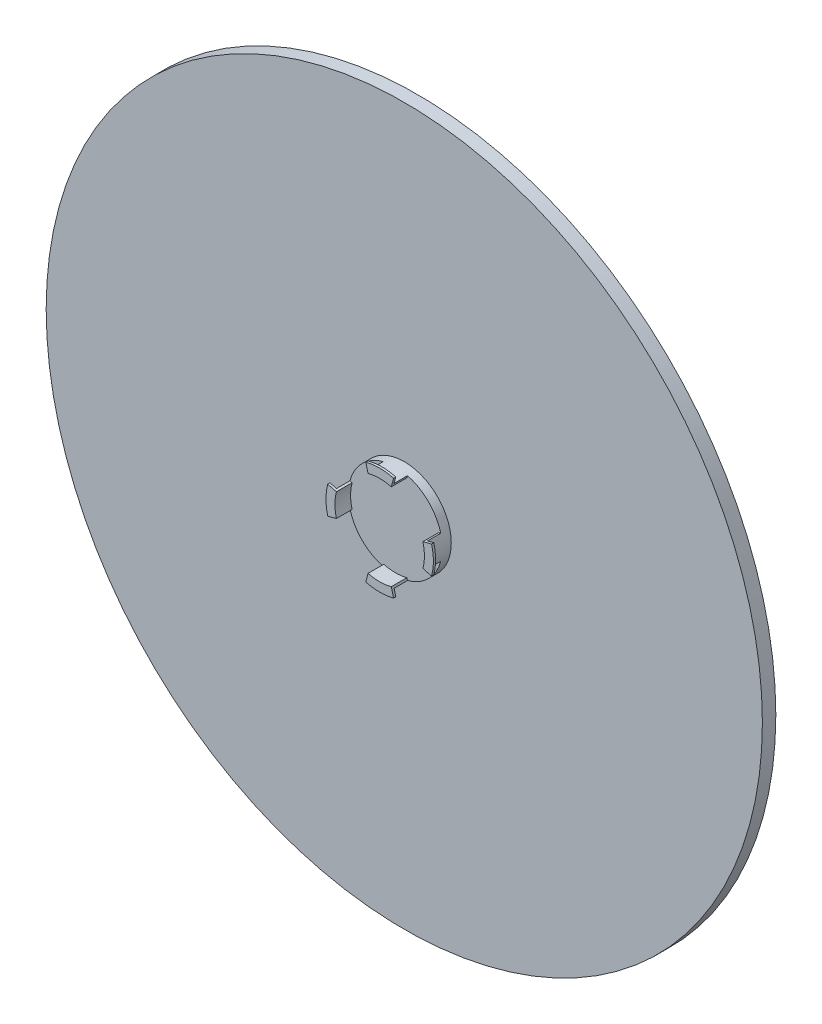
ISO-10303-21;
HEADER;
FILE_DESCRIPTION(('STEP AP214'),'2;1');
FILE_NAME('part.step','',(''),(''),'','','');
FILE_SCHEMA(('AUTOMOTIVE_DESIGN { 1 0 10303 214 1 1 1 1 }'));
ENDSEC;
DATA;
#1=APPLICATION_CONTEXT('core data for automotive mechanical design processes');
#2=APPLICATION_PROTOCOL_DEFINITION('international standard','automotive_design',2000,#1);
#3=PRODUCT_CONTEXT('',#1,'mechanical');
#4=PRODUCT('Part','Part','',(#3));
#5=PRODUCT_RELATED_PRODUCT_CATEGORY('part','',(#4));
#6=PRODUCT_DEFINITION_FORMATION('','',#4);
#7=PRODUCT_DEFINITION_CONTEXT('part definition',#1,'design');
#8=PRODUCT_DEFINITION('design','',#6,#7);
#9=PRODUCT_DEFINITION_SHAPE('','',#8);
#10=(LENGTH_UNIT() NAMED_UNIT(*) SI_UNIT(.MILLI.,.METRE.));
#11=(NAMED_UNIT(*) PLANE_ANGLE_UNIT() SI_UNIT($,.RADIAN.));
#12=(NAMED_UNIT(*) SI_UNIT($,.STERADIAN.) SOLID_ANGLE_UNIT());
#13=UNCERTAINTY_MEASURE_WITH_UNIT(LENGTH_MEASURE(1.E-05),#10,'distance_accuracy_value','');
#14=(GEOMETRIC_REPRESENTATION_CONTEXT(3) GLOBAL_UNCERTAINTY_ASSIGNED_CONTEXT((#13)) GLOBAL_UNIT_ASSIGNED_CONTEXT((#10,
#11,#12)) REPRESENTATION_CONTEXT('',''));
#15=CARTESIAN_POINT('',(0.,0.,0.));
#16=DIRECTION('',(0.,0.,1.));
#17=DIRECTION('',(1.,0.,0.));
#18=AXIS2_PLACEMENT_3D('',#15,#16,#17);
#19=CARTESIAN_POINT('',(-8.88178419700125E-13,8.88178419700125E-13,50.));
#20=DIRECTION('',(0.,0.,1.));
#21=DIRECTION('',(1.,0.,0.));
#22=AXIS2_PLACEMENT_3D('',#19,#20,#21);
#23=PLANE('',#22);
#24=CARTESIAN_POINT('',(-8.88178419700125E-13,8.88178419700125E-13,50.));
#25=DIRECTION('',(0.,0.,-1.));
#26=DIRECTION('',(1.,0.,0.));
#27=AXIS2_PLACEMENT_3D('',#24,#25,#26);
#28=CIRCLE('',#27,100.);
#29=CARTESIAN_POINT('',(25.8819045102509,-96.5925826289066,50.));
#30=VERTEX_POINT('',#29);
#31=CARTESIAN_POINT('',(-25.8819045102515,-96.592582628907,50.));
#32=VERTEX_POINT('',#31);
#33=EDGE_CURVE('E48',#30,#32,#28,.T.);
#34=ORIENTED_EDGE('',*,*,#33,.F.);
#35=DIRECTION('',(-0.258819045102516,0.965925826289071,0.));
#36=VECTOR('',#35,1.);
#37=CARTESIAN_POINT('',(25.8819045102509,-96.5925826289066,50.));
#38=LINE('',#37,#36);
#39=CARTESIAN_POINT('',(27.1759997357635,-101.422211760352,50.));
#40=VERTEX_POINT('',#39);
#41=EDGE_CURVE('E300',#40,#30,#38,.T.);
#42=ORIENTED_EDGE('',*,*,#41,.F.);
#43=CARTESIAN_POINT('',(-8.88178419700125E-13,8.88178419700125E-13,50.));
#44=DIRECTION('',(0.,0.,1.));
#45=DIRECTION('',(1.,0.,0.));
#46=AXIS2_PLACEMENT_3D('',#43,#44,#45);
#47=CIRCLE('',#46,105.);
#48=CARTESIAN_POINT('',(101.422211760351,-27.1759997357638,50.));
#49=VERTEX_POINT('',#48);
#50=EDGE_CURVE('E34',#40,#49,#47,.T.);
#51=ORIENTED_EDGE('',*,*,#50,.T.);
#52=DIRECTION('',(0.965925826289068,-0.258819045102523,0.));
#53=VECTOR('',#52,1.);
#54=CARTESIAN_POINT('',(96.5925826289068,-25.8819045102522,50.));
#55=LINE('',#54,#53);
#56=CARTESIAN_POINT('',(96.5925826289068,-25.8819045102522,50.));
#57=VERTEX_POINT('',#56);
#58=EDGE_CURVE('E318',#57,#49,#55,.T.);
#59=ORIENTED_EDGE('',*,*,#58,.F.);
#60=CARTESIAN_POINT('',(-8.88178419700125E-13,8.88178419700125E-13,50.));
#61=DIRECTION('',(0.,0.,-1.));
#62=DIRECTION('',(1.,0.,0.));
#63=AXIS2_PLACEMENT_3D('',#60,#61,#62);
#64=CIRCLE('',#63,100.);
#65=CARTESIAN_POINT('',(96.5925826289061,25.8819045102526,50.));
#66=VERTEX_POINT('',#65);
#67=EDGE_CURVE('E321',#66,#57,#64,.T.);
#68=ORIENTED_EDGE('',*,*,#67,.F.);
#69=DIRECTION('',(-0.965925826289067,-0.25881904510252,0.));
#70=VECTOR('',#69,1.);
#71=CARTESIAN_POINT('',(96.5925826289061,25.8819045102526,50.));
#72=LINE('',#71,#70);
#73=CARTESIAN_POINT('',(101.422211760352,27.1759997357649,50.));
#74=VERTEX_POINT('',#73);
#75=EDGE_CURVE('E313',#74,#66,#72,.T.);
#76=ORIENTED_EDGE('',*,*,#75,.F.);
#77=CARTESIAN_POINT('',(27.175999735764,101.422211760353,50.));
#78=VERTEX_POINT('',#77);
#79=EDGE_CURVE('E391',#74,#78,#47,.T.);
#80=ORIENTED_EDGE('',*,*,#79,.T.);
#81=DIRECTION('',(0.258819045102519,0.965925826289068,0.));
#82=VECTOR('',#81,1.);
#83=CARTESIAN_POINT('',(25.8819045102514,96.5925826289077,50.));
#84=LINE('',#83,#82);
#85=CARTESIAN_POINT('',(25.8819045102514,96.5925826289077,50.));
#86=VERTEX_POINT('',#85);
#87=EDGE_CURVE('E342',#86,#78,#84,.T.);
#88=ORIENTED_EDGE('',*,*,#87,.F.);
#89=CARTESIAN_POINT('',(-8.88178419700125E-13,8.88178419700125E-13,50.));
#90=DIRECTION('',(0.,0.,-1.));
#91=DIRECTION('',(1.,0.,0.));
#92=AXIS2_PLACEMENT_3D('',#89,#90,#91);
#93=CIRCLE('',#92,100.);
#94=CARTESIAN_POINT('',(-25.8819045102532,96.5925826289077,50.));
#95=VERTEX_POINT('',#94);
#96=EDGE_CURVE('E344',#95,#86,#93,.T.);
#97=ORIENTED_EDGE('',*,*,#96,.F.);
#98=DIRECTION('',(0.258819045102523,-0.965925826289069,0.));
#99=VECTOR('',#98,1.);
#100=CARTESIAN_POINT('',(-25.8819045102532,96.5925826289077,50.));
#101=LINE('',#100,#99);
#102=CARTESIAN_POINT('',(-27.1759997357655,101.422211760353,49.9999999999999));
#103=VERTEX_POINT('',#102);
#104=EDGE_CURVE('E337',#103,#95,#101,.T.);
#105=ORIENTED_EDGE('',*,*,#104,.F.);
#106=CARTESIAN_POINT('',(-101.422211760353,27.175999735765,50.));
#107=VERTEX_POINT('',#106);
#108=EDGE_CURVE('E390',#103,#107,#47,.T.);
#109=ORIENTED_EDGE('',*,*,#108,.T.);
#110=DIRECTION('',(-0.96592582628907,0.258819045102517,0.));
#111=VECTOR('',#110,1.);
#112=CARTESIAN_POINT('',(-96.5925826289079,25.8819045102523,50.));
#113=LINE('',#112,#111);
#114=CARTESIAN_POINT('',(-96.5925826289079,25.8819045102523,50.));
#115=VERTEX_POINT('',#114);
#116=EDGE_CURVE('E366',#115,#107,#113,.T.);
#117=ORIENTED_EDGE('',*,*,#116,.F.);
#118=CARTESIAN_POINT('',(-8.88178419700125E-13,8.88178419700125E-13,50.));
#119=DIRECTION('',(0.,0.,-1.));
#120=DIRECTION('',(1.,0.,0.));
#121=AXIS2_PLACEMENT_3D('',#118,#119,#120);
#122=CIRCLE('',#121,100.);
#123=CARTESIAN_POINT('',(-96.5925826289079,-25.8819045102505,50.));
#124=VERTEX_POINT('',#123);
#125=EDGE_CURVE('E358',#124,#115,#122,.T.);
#126=ORIENTED_EDGE('',*,*,#125,.F.);
#127=DIRECTION('',(0.96592582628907,0.258819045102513,0.));
#128=VECTOR('',#127,1.);
#129=CARTESIAN_POINT('',(-96.5925826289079,-25.8819045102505,50.));
#130=LINE('',#129,#128);
#131=CARTESIAN_POINT('',(-101.422211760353,-27.1759997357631,50.));
#132=VERTEX_POINT('',#131);
#133=EDGE_CURVE('E363',#132,#124,#130,.T.);
#134=ORIENTED_EDGE('',*,*,#133,.F.);
#135=CARTESIAN_POINT('',(-27.1759997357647,-101.422211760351,50.));
#136=VERTEX_POINT('',#135);
#137=EDGE_CURVE('E374',#132,#136,#47,.T.);
#138=ORIENTED_EDGE('',*,*,#137,.T.);
#139=DIRECTION('',(-0.258819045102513,-0.96592582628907,0.));
#140=VECTOR('',#139,1.);
#141=CARTESIAN_POINT('',(-25.8819045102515,-96.592582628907,50.));
#142=LINE('',#141,#140);
#143=EDGE_CURVE('E53',#32,#136,#142,.T.);
#144=ORIENTED_EDGE('',*,*,#143,.F.);
#145=EDGE_LOOP('',(#34,#42,#51,#59,#68,#76,#80,#88,#97,#105,#109,#117,#126,#134,#138,#144));
#146=FACE_BOUND('',#145,.T.);
#147=ADVANCED_FACE('F30',(#146),#23,.T.);
#148=CARTESIAN_POINT('',(0.,0.,30.));
#149=DIRECTION('',(0.,0.,1.));
#150=DIRECTION('',(1.,0.,0.));
#151=AXIS2_PLACEMENT_3D('',#148,#149,#150);
#152=PLANE('',#151);
#153=CARTESIAN_POINT('',(0.,0.,30.));
#154=DIRECTION('',(0.,0.,1.));
#155=DIRECTION('',(1.,0.,0.));
#156=AXIS2_PLACEMENT_3D('',#153,#154,#155);
#157=CIRCLE('',#156,800.);
#158=CARTESIAN_POINT('',(800.,-1.19904086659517E-12,30.));
#159=VERTEX_POINT('',#158);
#160=EDGE_CURVE('E11',#159,#159,#157,.T.);
#161=ORIENTED_EDGE('',*,*,#160,.T.);
#162=EDGE_LOOP('',(#161));
#163=FACE_BOUND('',#162,.T.);
#164=CARTESIAN_POINT('',(0.,0.,30.));
#165=DIRECTION('',(0.,0.,1.));
#166=DIRECTION('',(1.,0.,0.));
#167=AXIS2_PLACEMENT_3D('',#164,#165,#166);
#168=CIRCLE('',#167,105.);
#169=CARTESIAN_POINT('',(105.,-1.57374113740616E-13,30.));
#170=VERTEX_POINT('',#169);
#171=EDGE_CURVE('E392',#170,#170,#168,.T.);
#172=ORIENTED_EDGE('',*,*,#171,.F.);
#173=EDGE_LOOP('',(#172));
#174=FACE_BOUND('',#173,.T.);
#175=ADVANCED_FACE('F443',(#163,#174),#152,.T.);
#176=CARTESIAN_POINT('',(0.,0.,30.));
#177=DIRECTION('',(0.,0.,-1.));
#178=DIRECTION('',(-1.,0.,0.));
#179=AXIS2_PLACEMENT_3D('',#176,#177,#178);
#180=CYLINDRICAL_SURFACE('',#179,800.);
#181=ORIENTED_EDGE('',*,*,#160,.F.);
#182=EDGE_LOOP('',(#181));
#183=FACE_BOUND('',#182,.T.);
#184=CARTESIAN_POINT('',(0.,-1.11022302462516E-13,0.));
#185=DIRECTION('',(0.,0.,1.));
#186=DIRECTION('',(1.,0.,0.));
#187=AXIS2_PLACEMENT_3D('',#184,#185,#186);
#188=CIRCLE('',#187,800.);
#189=CARTESIAN_POINT('',(800.,-1.31006316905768E-12,0.));
#190=VERTEX_POINT('',#189);
#191=EDGE_CURVE('E40',#190,#190,#188,.T.);
#192=ORIENTED_EDGE('',*,*,#191,.T.);
#193=EDGE_LOOP('',(#192));
#194=FACE_BOUND('',#193,.T.);
#195=ADVANCED_FACE('F32',(#183,#194),#180,.T.);
#196=CARTESIAN_POINT('',(0.,-1.11022302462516E-13,0.));
#197=DIRECTION('',(0.,0.,1.));
#198=DIRECTION('',(1.,0.,0.));
#199=AXIS2_PLACEMENT_3D('',#196,#197,#198);
#200=PLANE('',#199);
#201=ORIENTED_EDGE('',*,*,#191,.F.);
#202=EDGE_LOOP('',(#201));
#203=FACE_BOUND('',#202,.T.);
#204=ADVANCED_FACE('F454',(#203),#200,.F.);
#205=CARTESIAN_POINT('',(-8.88178419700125E-13,8.88178419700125E-13,50.));
#206=DIRECTION('',(0.,0.,-1.));
#207=DIRECTION('',(-1.,0.,0.));
#208=AXIS2_PLACEMENT_3D('',#205,#206,#207);
#209=CYLINDRICAL_SURFACE('',#208,105.);
#210=ORIENTED_EDGE('',*,*,#137,.F.);
#211=DIRECTION('',(0.,0.,-1.));
#212=VECTOR('',#211,1.);
#213=CARTESIAN_POINT('',(-101.422211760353,-27.1759997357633,80.));
#214=LINE('',#213,#212);
#215=CARTESIAN_POINT('',(-101.422211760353,-27.1759997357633,80.));
#216=VERTEX_POINT('',#215);
#217=EDGE_CURVE('E379',#216,#132,#214,.T.);
#218=ORIENTED_EDGE('',*,*,#217,.F.);
#219=CARTESIAN_POINT('',(-9.99200722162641E-13,9.99200722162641E-13,80.));
#220=DIRECTION('',(0.,0.,1.));
#221=DIRECTION('',(1.,0.,0.));
#222=AXIS2_PLACEMENT_3D('',#219,#220,#221);
#223=CIRCLE('',#222,105.);
#224=CARTESIAN_POINT('',(-101.422211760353,27.1759997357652,80.));
#225=VERTEX_POINT('',#224);
#226=EDGE_CURVE('E359',#225,#216,#223,.T.);
#227=ORIENTED_EDGE('',*,*,#226,.F.);
#228=DIRECTION('',(0.,0.,-1.));
#229=VECTOR('',#228,1.);
#230=CARTESIAN_POINT('',(-101.422211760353,27.1759997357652,80.));
#231=LINE('',#230,#229);
#232=EDGE_CURVE('E375',#225,#107,#231,.T.);
#233=ORIENTED_EDGE('',*,*,#232,.T.);
#234=ORIENTED_EDGE('',*,*,#108,.F.);
#235=DIRECTION('',(0.,0.,-1.));
#236=VECTOR('',#235,1.);
#237=CARTESIAN_POINT('',(-27.1759997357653,101.422211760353,80.));
#238=LINE('',#237,#236);
#239=CARTESIAN_POINT('',(-27.1759997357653,101.422211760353,80.));
#240=VERTEX_POINT('',#239);
#241=EDGE_CURVE('E356',#240,#103,#238,.T.);
#242=ORIENTED_EDGE('',*,*,#241,.F.);
#243=CARTESIAN_POINT('',(-9.99200722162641E-13,9.99200722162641E-13,80.));
#244=DIRECTION('',(0.,0.,1.));
#245=DIRECTION('',(1.,0.,0.));
#246=AXIS2_PLACEMENT_3D('',#243,#244,#245);
#247=CIRCLE('',#246,105.);
#248=CARTESIAN_POINT('',(27.1759997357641,101.422211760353,80.));
#249=VERTEX_POINT('',#248);
#250=EDGE_CURVE('E338',#249,#240,#247,.T.);
#251=ORIENTED_EDGE('',*,*,#250,.F.);
#252=DIRECTION('',(0.,0.,-1.));
#253=VECTOR('',#252,1.);
#254=CARTESIAN_POINT('',(27.1759997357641,101.422211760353,80.));
#255=LINE('',#254,#253);
#256=EDGE_CURVE('E341',#249,#78,#255,.T.);
#257=ORIENTED_EDGE('',*,*,#256,.T.);
#258=ORIENTED_EDGE('',*,*,#79,.F.);
#259=DIRECTION('',(0.,0.,-1.));
#260=VECTOR('',#259,1.);
#261=CARTESIAN_POINT('',(101.422211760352,27.175999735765,80.));
#262=LINE('',#261,#260);
#263=CARTESIAN_POINT('',(101.422211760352,27.175999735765,80.));
#264=VERTEX_POINT('',#263);
#265=EDGE_CURVE('E334',#264,#74,#262,.T.);
#266=ORIENTED_EDGE('',*,*,#265,.F.);
#267=CARTESIAN_POINT('',(-9.99200722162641E-13,9.99200722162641E-13,80.));
#268=DIRECTION('',(0.,0.,1.));
#269=DIRECTION('',(1.,0.,0.));
#270=AXIS2_PLACEMENT_3D('',#267,#268,#269);
#271=CIRCLE('',#270,105.);
#272=CARTESIAN_POINT('',(101.422211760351,-27.1759997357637,80.));
#273=VERTEX_POINT('',#272);
#274=EDGE_CURVE('E314',#273,#264,#271,.T.);
#275=ORIENTED_EDGE('',*,*,#274,.F.);
#276=DIRECTION('',(0.,0.,-1.));
#277=VECTOR('',#276,1.);
#278=CARTESIAN_POINT('',(101.422211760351,-27.1759997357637,80.));
#279=LINE('',#278,#277);
#280=EDGE_CURVE('E317',#273,#49,#279,.T.);
#281=ORIENTED_EDGE('',*,*,#280,.T.);
#282=ORIENTED_EDGE('',*,*,#50,.F.);
#283=DIRECTION('',(0.,0.,-1.));
#284=VECTOR('',#283,1.);
#285=CARTESIAN_POINT('',(27.1759997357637,-101.422211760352,80.));
#286=LINE('',#285,#284);
#287=CARTESIAN_POINT('',(27.1759997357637,-101.422211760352,80.));
#288=VERTEX_POINT('',#287);
#289=EDGE_CURVE('E310',#288,#40,#286,.T.);
#290=ORIENTED_EDGE('',*,*,#289,.F.);
#291=CARTESIAN_POINT('',(-9.99200722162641E-13,9.99200722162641E-13,80.));
#292=DIRECTION('',(0.,0.,1.));
#293=DIRECTION('',(1.,0.,0.));
#294=AXIS2_PLACEMENT_3D('',#291,#292,#293);
#295=CIRCLE('',#294,105.);
#296=CARTESIAN_POINT('',(-27.1759997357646,-101.422211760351,80.));
#297=VERTEX_POINT('',#296);
#298=EDGE_CURVE('E301',#297,#288,#295,.T.);
#299=ORIENTED_EDGE('',*,*,#298,.F.);
#300=DIRECTION('',(0.,0.,-1.));
#301=VECTOR('',#300,1.);
#302=CARTESIAN_POINT('',(-27.1759997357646,-101.422211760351,80.));
#303=LINE('',#302,#301);
#304=EDGE_CURVE('E201',#297,#136,#303,.T.);
#305=ORIENTED_EDGE('',*,*,#304,.T.);
#306=EDGE_LOOP('',(#210,#218,#227,#233,#234,#242,#251,#257,#258,#266,#275,#281,#282,#290,#299,#305));
#307=FACE_BOUND('',#306,.T.);
#308=ORIENTED_EDGE('',*,*,#171,.T.);
#309=EDGE_LOOP('',(#308));
#310=FACE_BOUND('',#309,.T.);
#311=ADVANCED_FACE('F417',(#307,#310),#209,.T.);
#312=CARTESIAN_POINT('',(-9.99200722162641E-13,9.99200722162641E-13,80.));
#313=DIRECTION('',(0.,0.,-1.));
#314=DIRECTION('',(-1.,0.,0.));
#315=AXIS2_PLACEMENT_3D('',#312,#313,#314);
#316=CYLINDRICAL_SURFACE('',#315,100.);
#317=ORIENTED_EDGE('',*,*,#125,.T.);
#318=DIRECTION('',(0.,0.,-1.));
#319=VECTOR('',#318,1.);
#320=CARTESIAN_POINT('',(-96.5925826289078,25.8819045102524,80.));
#321=LINE('',#320,#319);
#322=CARTESIAN_POINT('',(-96.5925826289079,25.8819045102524,85.));
#323=VERTEX_POINT('',#322);
#324=EDGE_CURVE('E378',#323,#115,#321,.T.);
#325=ORIENTED_EDGE('',*,*,#324,.F.);
#326=CARTESIAN_POINT('',(-8.88178419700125E-13,9.99200722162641E-13,85.));
#327=DIRECTION('',(0.,0.,-1.));
#328=DIRECTION('',(1.,0.,0.));
#329=AXIS2_PLACEMENT_3D('',#326,#327,#328);
#330=CIRCLE('',#329,100.);
#331=CARTESIAN_POINT('',(-96.5925826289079,-25.8819045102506,85.));
#332=VERTEX_POINT('',#331);
#333=EDGE_CURVE('E232',#332,#323,#330,.T.);
#334=ORIENTED_EDGE('',*,*,#333,.F.);
#335=DIRECTION('',(0.,0.,-1.));
#336=VECTOR('',#335,1.);
#337=CARTESIAN_POINT('',(-96.5925826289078,-25.8819045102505,80.));
#338=LINE('',#337,#336);
#339=EDGE_CURVE('E362',#332,#124,#338,.T.);
#340=ORIENTED_EDGE('',*,*,#339,.T.);
#341=EDGE_LOOP('',(#317,#325,#334,#340));
#342=FACE_BOUND('',#341,.T.);
#343=ADVANCED_FACE('F409',(#342),#316,.F.);
#344=CARTESIAN_POINT('',(-96.5925826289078,25.8819045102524,80.));
#345=DIRECTION('',(-0.258819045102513,-0.96592582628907,0.));
#346=DIRECTION('',(0.96592582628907,-0.258819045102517,0.));
#347=AXIS2_PLACEMENT_3D('',#344,#345,#346);
#348=PLANE('',#347);
#349=ORIENTED_EDGE('',*,*,#116,.T.);
#350=ORIENTED_EDGE('',*,*,#232,.F.);
#351=DIRECTION('',(-0.96592582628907,0.258819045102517,0.));
#352=VECTOR('',#351,1.);
#353=CARTESIAN_POINT('',(-96.5925826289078,25.8819045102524,80.));
#354=LINE('',#353,#352);
#355=CARTESIAN_POINT('',(-115.911099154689,31.0582854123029,80.));
#356=VERTEX_POINT('',#355);
#357=EDGE_CURVE('E231',#225,#356,#354,.T.);
#358=ORIENTED_EDGE('',*,*,#357,.T.);
#359=DIRECTION('',(0.,0.,-1.));
#360=VECTOR('',#359,1.);
#361=CARTESIAN_POINT('',(-115.911099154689,31.0582854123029,85.));
#362=LINE('',#361,#360);
#363=CARTESIAN_POINT('',(-115.911099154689,31.0582854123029,85.));
#364=VERTEX_POINT('',#363);
#365=EDGE_CURVE('E251',#364,#356,#362,.T.);
#366=ORIENTED_EDGE('',*,*,#365,.F.);
#367=DIRECTION('',(-0.96592582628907,0.258819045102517,0.));
#368=VECTOR('',#367,1.);
#369=CARTESIAN_POINT('',(-96.5925826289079,25.8819045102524,85.));
#370=LINE('',#369,#368);
#371=EDGE_CURVE('E235',#323,#364,#370,.T.);
#372=ORIENTED_EDGE('',*,*,#371,.F.);
#373=ORIENTED_EDGE('',*,*,#324,.T.);
#374=EDGE_LOOP('',(#349,#350,#358,#366,#372,#373));
#375=FACE_BOUND('',#374,.T.);
#376=ADVANCED_FACE('F404',(#375),#348,.F.);
#377=CARTESIAN_POINT('',(-96.5925826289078,-25.8819045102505,80.));
#378=DIRECTION('',(-0.258819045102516,0.965925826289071,0.));
#379=DIRECTION('',(-0.96592582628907,-0.258819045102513,0.));
#380=AXIS2_PLACEMENT_3D('',#377,#378,#379);
#381=PLANE('',#380);
#382=ORIENTED_EDGE('',*,*,#133,.T.);
#383=ORIENTED_EDGE('',*,*,#339,.F.);
#384=DIRECTION('',(0.96592582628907,0.258819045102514,0.));
#385=VECTOR('',#384,1.);
#386=CARTESIAN_POINT('',(-96.5925826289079,-25.8819045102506,85.));
#387=LINE('',#386,#385);
#388=CARTESIAN_POINT('',(-115.911099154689,-31.0582854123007,85.));
#389=VERTEX_POINT('',#388);
#390=EDGE_CURVE('E240',#389,#332,#387,.T.);
#391=ORIENTED_EDGE('',*,*,#390,.F.);
#392=DIRECTION('',(0.,0.,-1.));
#393=VECTOR('',#392,1.);
#394=CARTESIAN_POINT('',(-115.911099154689,-31.0582854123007,85.));
#395=LINE('',#394,#393);
#396=CARTESIAN_POINT('',(-115.911099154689,-31.0582854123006,80.));
#397=VERTEX_POINT('',#396);
#398=EDGE_CURVE('E243',#389,#397,#395,.T.);
#399=ORIENTED_EDGE('',*,*,#398,.T.);
#400=DIRECTION('',(0.96592582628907,0.258819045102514,0.));
#401=VECTOR('',#400,1.);
#402=CARTESIAN_POINT('',(-96.5925826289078,-25.8819045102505,80.));
#403=LINE('',#402,#401);
#404=EDGE_CURVE('E236',#397,#216,#403,.T.);
#405=ORIENTED_EDGE('',*,*,#404,.T.);
#406=ORIENTED_EDGE('',*,*,#217,.T.);
#407=EDGE_LOOP('',(#382,#383,#391,#399,#405,#406));
#408=FACE_BOUND('',#407,.T.);
#409=ADVANCED_FACE('F412',(#408),#381,.F.);
#410=CARTESIAN_POINT('',(-25.8819045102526,96.5925826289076,80.));
#411=DIRECTION('',(0.965925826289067,0.25881904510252,0.));
#412=DIRECTION('',(-0.258819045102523,0.965925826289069,0.));
#413=AXIS2_PLACEMENT_3D('',#410,#411,#412);
#414=PLANE('',#413);
#415=ORIENTED_EDGE('',*,*,#104,.T.);
#416=DIRECTION('',(0.,0.,-1.));
#417=VECTOR('',#416,1.);
#418=CARTESIAN_POINT('',(-25.8819045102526,96.5925826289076,80.));
#419=LINE('',#418,#417);
#420=CARTESIAN_POINT('',(-25.8819045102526,96.5925826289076,85.));
#421=VERTEX_POINT('',#420);
#422=EDGE_CURVE('E353',#421,#95,#419,.T.);
#423=ORIENTED_EDGE('',*,*,#422,.F.);
#424=DIRECTION('',(0.258819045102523,-0.965925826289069,0.));
#425=VECTOR('',#424,1.);
#426=CARTESIAN_POINT('',(-25.8819045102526,96.5925826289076,85.));
#427=LINE('',#426,#425);
#428=CARTESIAN_POINT('',(-31.0582854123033,115.911099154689,84.9999999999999));
#429=VERTEX_POINT('',#428);
#430=EDGE_CURVE('E286',#429,#421,#427,.T.);
#431=ORIENTED_EDGE('',*,*,#430,.F.);
#432=DIRECTION('',(0.,0.,-1.));
#433=VECTOR('',#432,1.);
#434=CARTESIAN_POINT('',(-31.0582854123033,115.911099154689,84.9999999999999));
#435=LINE('',#434,#433);
#436=CARTESIAN_POINT('',(-31.0582854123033,115.911099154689,79.9999999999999));
#437=VERTEX_POINT('',#436);
#438=EDGE_CURVE('E289',#429,#437,#435,.T.);
#439=ORIENTED_EDGE('',*,*,#438,.T.);
#440=DIRECTION('',(0.258819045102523,-0.965925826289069,0.));
#441=VECTOR('',#440,1.);
#442=CARTESIAN_POINT('',(-25.8819045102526,96.5925826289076,80.));
#443=LINE('',#442,#441);
#444=EDGE_CURVE('E282',#437,#240,#443,.T.);
#445=ORIENTED_EDGE('',*,*,#444,.T.);
#446=ORIENTED_EDGE('',*,*,#241,.T.);
#447=EDGE_LOOP('',(#415,#423,#431,#439,#445,#446));
#448=FACE_BOUND('',#447,.T.);
#449=ADVANCED_FACE('F515',(#448),#414,.F.);
#450=CARTESIAN_POINT('',(-9.99200722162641E-13,9.99200722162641E-13,80.));
#451=DIRECTION('',(0.,0.,-1.));
#452=DIRECTION('',(-1.,0.,0.));
#453=AXIS2_PLACEMENT_3D('',#450,#451,#452);
#454=CYLINDRICAL_SURFACE('',#453,100.);
#455=ORIENTED_EDGE('',*,*,#96,.T.);
#456=DIRECTION('',(0.,0.,-1.));
#457=VECTOR('',#456,1.);
#458=CARTESIAN_POINT('',(25.8819045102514,96.5925826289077,80.));
#459=LINE('',#458,#457);
#460=CARTESIAN_POINT('',(25.8819045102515,96.5925826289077,85.));
#461=VERTEX_POINT('',#460);
#462=EDGE_CURVE('E351',#461,#86,#459,.T.);
#463=ORIENTED_EDGE('',*,*,#462,.F.);
#464=CARTESIAN_POINT('',(-8.88178419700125E-13,9.99200722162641E-13,85.));
#465=DIRECTION('',(0.,0.,-1.));
#466=DIRECTION('',(1.,0.,0.));
#467=AXIS2_PLACEMENT_3D('',#464,#465,#466);
#468=CIRCLE('',#467,100.);
#469=EDGE_CURVE('E278',#421,#461,#468,.T.);
#470=ORIENTED_EDGE('',*,*,#469,.F.);
#471=ORIENTED_EDGE('',*,*,#422,.T.);
#472=EDGE_LOOP('',(#455,#463,#470,#471));
#473=FACE_BOUND('',#472,.T.);
#474=ADVANCED_FACE('F524',(#473),#454,.F.);
#475=CARTESIAN_POINT('',(25.8819045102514,96.5925826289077,80.));
#476=DIRECTION('',(-0.965925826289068,0.258819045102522,0.));
#477=DIRECTION('',(-0.258819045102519,-0.965925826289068,0.));
#478=AXIS2_PLACEMENT_3D('',#475,#476,#477);
#479=PLANE('',#478);
#480=ORIENTED_EDGE('',*,*,#87,.T.);
#481=ORIENTED_EDGE('',*,*,#256,.F.);
#482=DIRECTION('',(0.25881904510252,0.965925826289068,0.));
#483=VECTOR('',#482,1.);
#484=CARTESIAN_POINT('',(25.8819045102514,96.5925826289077,80.));
#485=LINE('',#484,#483);
#486=CARTESIAN_POINT('',(31.058285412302,115.911099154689,80.));
#487=VERTEX_POINT('',#486);
#488=EDGE_CURVE('E277',#249,#487,#485,.T.);
#489=ORIENTED_EDGE('',*,*,#488,.T.);
#490=DIRECTION('',(0.,0.,-1.));
#491=VECTOR('',#490,1.);
#492=CARTESIAN_POINT('',(31.0582854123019,115.911099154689,85.));
#493=LINE('',#492,#491);
#494=CARTESIAN_POINT('',(31.0582854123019,115.911099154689,85.));
#495=VERTEX_POINT('',#494);
#496=EDGE_CURVE('E297',#495,#487,#493,.T.);
#497=ORIENTED_EDGE('',*,*,#496,.F.);
#498=DIRECTION('',(0.25881904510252,0.965925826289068,0.));
#499=VECTOR('',#498,1.);
#500=CARTESIAN_POINT('',(25.8819045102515,96.5925826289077,85.));
#501=LINE('',#500,#499);
#502=EDGE_CURVE('E281',#461,#495,#501,.T.);
#503=ORIENTED_EDGE('',*,*,#502,.F.);
#504=ORIENTED_EDGE('',*,*,#462,.T.);
#505=EDGE_LOOP('',(#480,#481,#489,#497,#503,#504));
#506=FACE_BOUND('',#505,.T.);
#507=ADVANCED_FACE('F534',(#506),#479,.F.);
#508=CARTESIAN_POINT('',(96.5925826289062,25.8819045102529,80.));
#509=DIRECTION('',(0.258819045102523,-0.965925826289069,0.));
#510=DIRECTION('',(0.965925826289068,0.25881904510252,0.));
#511=AXIS2_PLACEMENT_3D('',#508,#509,#510);
#512=PLANE('',#511);
#513=ORIENTED_EDGE('',*,*,#75,.T.);
#514=DIRECTION('',(0.,0.,-1.));
#515=VECTOR('',#514,1.);
#516=CARTESIAN_POINT('',(96.5925826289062,25.8819045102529,80.));
#517=LINE('',#516,#515);
#518=CARTESIAN_POINT('',(96.5925826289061,25.8819045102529,85.));
#519=VERTEX_POINT('',#518);
#520=EDGE_CURVE('E331',#519,#66,#517,.T.);
#521=ORIENTED_EDGE('',*,*,#520,.F.);
#522=DIRECTION('',(-0.965925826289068,-0.258819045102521,0.));
#523=VECTOR('',#522,1.);
#524=CARTESIAN_POINT('',(96.5925826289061,25.8819045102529,85.));
#525=LINE('',#524,#523);
#526=CARTESIAN_POINT('',(115.911099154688,31.0582854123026,85.));
#527=VERTEX_POINT('',#526);
#528=EDGE_CURVE('E263',#527,#519,#525,.T.);
#529=ORIENTED_EDGE('',*,*,#528,.F.);
#530=DIRECTION('',(0.,0.,-1.));
#531=VECTOR('',#530,1.);
#532=CARTESIAN_POINT('',(115.911099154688,31.0582854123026,85.));
#533=LINE('',#532,#531);
#534=CARTESIAN_POINT('',(115.911099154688,31.0582854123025,80.));
#535=VERTEX_POINT('',#534);
#536=EDGE_CURVE('E266',#527,#535,#533,.T.);
#537=ORIENTED_EDGE('',*,*,#536,.T.);
#538=DIRECTION('',(-0.965925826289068,-0.258819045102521,0.));
#539=VECTOR('',#538,1.);
#540=CARTESIAN_POINT('',(96.5925826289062,25.8819045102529,80.));
#541=LINE('',#540,#539);
#542=EDGE_CURVE('E259',#535,#264,#541,.T.);
#543=ORIENTED_EDGE('',*,*,#542,.T.);
#544=ORIENTED_EDGE('',*,*,#265,.T.);
#545=EDGE_LOOP('',(#513,#521,#529,#537,#543,#544));
#546=FACE_BOUND('',#545,.T.);
#547=ADVANCED_FACE('F544',(#546),#512,.F.);
#548=CARTESIAN_POINT('',(-9.99200722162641E-13,9.99200722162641E-13,80.));
#549=DIRECTION('',(0.,0.,-1.));
#550=DIRECTION('',(-1.,0.,0.));
#551=AXIS2_PLACEMENT_3D('',#548,#549,#550);
#552=CYLINDRICAL_SURFACE('',#551,100.);
#553=ORIENTED_EDGE('',*,*,#67,.T.);
#554=DIRECTION('',(0.,0.,-1.));
#555=VECTOR('',#554,1.);
#556=CARTESIAN_POINT('',(96.5925826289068,-25.8819045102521,80.));
#557=LINE('',#556,#555);
#558=CARTESIAN_POINT('',(96.5925826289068,-25.8819045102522,85.));
#559=VERTEX_POINT('',#558);
#560=EDGE_CURVE('E328',#559,#57,#557,.T.);
#561=ORIENTED_EDGE('',*,*,#560,.F.);
#562=CARTESIAN_POINT('',(-8.88178419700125E-13,9.99200722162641E-13,85.));
#563=DIRECTION('',(0.,0.,-1.));
#564=DIRECTION('',(1.,0.,0.));
#565=AXIS2_PLACEMENT_3D('',#562,#563,#564);
#566=CIRCLE('',#565,100.);
#567=EDGE_CURVE('E255',#519,#559,#566,.T.);
#568=ORIENTED_EDGE('',*,*,#567,.F.);
#569=ORIENTED_EDGE('',*,*,#520,.T.);
#570=EDGE_LOOP('',(#553,#561,#568,#569));
#571=FACE_BOUND('',#570,.T.);
#572=ADVANCED_FACE('F554',(#571),#552,.F.);
#573=CARTESIAN_POINT('',(96.5925826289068,-25.8819045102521,80.));
#574=DIRECTION('',(0.25881904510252,0.965925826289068,0.));
#575=DIRECTION('',(-0.965925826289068,0.258819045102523,0.));
#576=AXIS2_PLACEMENT_3D('',#573,#574,#575);
#577=PLANE('',#576);
#578=ORIENTED_EDGE('',*,*,#58,.T.);
#579=ORIENTED_EDGE('',*,*,#280,.F.);
#580=DIRECTION('',(0.965925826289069,-0.258819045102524,0.));
#581=VECTOR('',#580,1.);
#582=CARTESIAN_POINT('',(96.5925826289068,-25.8819045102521,80.));
#583=LINE('',#582,#581);
#584=CARTESIAN_POINT('',(115.911099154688,-31.0582854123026,80.));
#585=VERTEX_POINT('',#584);
#586=EDGE_CURVE('E254',#273,#585,#583,.T.);
#587=ORIENTED_EDGE('',*,*,#586,.T.);
#588=DIRECTION('',(0.,0.,-1.));
#589=VECTOR('',#588,1.);
#590=CARTESIAN_POINT('',(115.911099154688,-31.0582854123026,85.));
#591=LINE('',#590,#589);
#592=CARTESIAN_POINT('',(115.911099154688,-31.0582854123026,85.));
#593=VERTEX_POINT('',#592);
#594=EDGE_CURVE('E274',#593,#585,#591,.T.);
#595=ORIENTED_EDGE('',*,*,#594,.F.);
#596=DIRECTION('',(0.965925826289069,-0.258819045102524,0.));
#597=VECTOR('',#596,1.);
#598=CARTESIAN_POINT('',(96.5925826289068,-25.8819045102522,85.));
#599=LINE('',#598,#597);
#600=EDGE_CURVE('E258',#559,#593,#599,.T.);
#601=ORIENTED_EDGE('',*,*,#600,.F.);
#602=ORIENTED_EDGE('',*,*,#560,.T.);
#603=EDGE_LOOP('',(#578,#579,#587,#595,#601,#602));
#604=FACE_BOUND('',#603,.T.);
#605=ADVANCED_FACE('F564',(#604),#577,.F.);
#606=CARTESIAN_POINT('',(25.881904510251,-96.5925826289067,80.));
#607=DIRECTION('',(-0.965925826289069,-0.258819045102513,0.));
#608=DIRECTION('',(0.258819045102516,-0.965925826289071,0.));
#609=AXIS2_PLACEMENT_3D('',#606,#607,#608);
#610=PLANE('',#609);
#611=ORIENTED_EDGE('',*,*,#41,.T.);
#612=DIRECTION('',(0.,0.,-1.));
#613=VECTOR('',#612,1.);
#614=CARTESIAN_POINT('',(25.881904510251,-96.5925826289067,80.));
#615=LINE('',#614,#613);
#616=CARTESIAN_POINT('',(25.8819045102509,-96.5925826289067,85.));
#617=VERTEX_POINT('',#616);
#618=EDGE_CURVE('E200',#617,#30,#615,.T.);
#619=ORIENTED_EDGE('',*,*,#618,.F.);
#620=DIRECTION('',(-0.258819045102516,0.965925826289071,0.));
#621=VECTOR('',#620,1.);
#622=CARTESIAN_POINT('',(25.8819045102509,-96.5925826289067,85.));
#623=LINE('',#622,#621);
#624=CARTESIAN_POINT('',(31.058285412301,-115.911099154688,85.));
#625=VERTEX_POINT('',#624);
#626=EDGE_CURVE('E215',#625,#617,#623,.T.);
#627=ORIENTED_EDGE('',*,*,#626,.F.);
#628=DIRECTION('',(0.,0.,-1.));
#629=VECTOR('',#628,1.);
#630=CARTESIAN_POINT('',(31.058285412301,-115.911099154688,85.));
#631=LINE('',#630,#629);
#632=CARTESIAN_POINT('',(31.0582854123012,-115.911099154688,80.));
#633=VERTEX_POINT('',#632);
#634=EDGE_CURVE('E224',#625,#633,#631,.T.);
#635=ORIENTED_EDGE('',*,*,#634,.T.);
#636=DIRECTION('',(-0.258819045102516,0.965925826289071,0.));
#637=VECTOR('',#636,1.);
#638=CARTESIAN_POINT('',(25.881904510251,-96.5925826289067,80.));
#639=LINE('',#638,#637);
#640=EDGE_CURVE('E216',#633,#288,#639,.T.);
#641=ORIENTED_EDGE('',*,*,#640,.T.);
#642=ORIENTED_EDGE('',*,*,#289,.T.);
#643=EDGE_LOOP('',(#611,#619,#627,#635,#641,#642));
#644=FACE_BOUND('',#643,.T.);
#645=ADVANCED_FACE('F574',(#644),#610,.F.);
#646=CARTESIAN_POINT('',(-9.99200722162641E-13,9.99200722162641E-13,80.));
#647=DIRECTION('',(0.,0.,-1.));
#648=DIRECTION('',(-1.,0.,0.));
#649=AXIS2_PLACEMENT_3D('',#646,#647,#648);
#650=CYLINDRICAL_SURFACE('',#649,100.);
#651=ORIENTED_EDGE('',*,*,#33,.T.);
#652=DIRECTION('',(0.,0.,-1.));
#653=VECTOR('',#652,1.);
#654=CARTESIAN_POINT('',(-25.8819045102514,-96.592582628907,80.));
#655=LINE('',#654,#653);
#656=CARTESIAN_POINT('',(-25.8819045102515,-96.592582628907,85.));
#657=VERTEX_POINT('',#656);
#658=EDGE_CURVE('E193',#657,#32,#655,.T.);
#659=ORIENTED_EDGE('',*,*,#658,.F.);
#660=CARTESIAN_POINT('',(-8.88178419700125E-13,9.99200722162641E-13,85.));
#661=DIRECTION('',(0.,0.,-1.));
#662=DIRECTION('',(1.,0.,0.));
#663=AXIS2_PLACEMENT_3D('',#660,#661,#662);
#664=CIRCLE('',#663,100.);
#665=EDGE_CURVE('E198',#617,#657,#664,.T.);
#666=ORIENTED_EDGE('',*,*,#665,.F.);
#667=ORIENTED_EDGE('',*,*,#618,.T.);
#668=EDGE_LOOP('',(#651,#659,#666,#667));
#669=FACE_BOUND('',#668,.T.);
#670=ADVANCED_FACE('F195',(#669),#650,.F.);
#671=CARTESIAN_POINT('',(-25.8819045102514,-96.592582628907,80.));
#672=DIRECTION('',(0.96592582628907,-0.258819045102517,0.));
#673=DIRECTION('',(0.258819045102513,0.96592582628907,0.));
#674=AXIS2_PLACEMENT_3D('',#671,#672,#673);
#675=PLANE('',#674);
#676=ORIENTED_EDGE('',*,*,#143,.T.);
#677=ORIENTED_EDGE('',*,*,#304,.F.);
#678=DIRECTION('',(-0.258819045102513,-0.96592582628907,0.));
#679=VECTOR('',#678,1.);
#680=CARTESIAN_POINT('',(-25.8819045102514,-96.592582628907,80.));
#681=LINE('',#680,#679);
#682=CARTESIAN_POINT('',(-31.0582854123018,-115.911099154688,80.));
#683=VERTEX_POINT('',#682);
#684=EDGE_CURVE('E225',#297,#683,#681,.T.);
#685=ORIENTED_EDGE('',*,*,#684,.T.);
#686=DIRECTION('',(0.,0.,-1.));
#687=VECTOR('',#686,1.);
#688=CARTESIAN_POINT('',(-31.0582854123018,-115.911099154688,85.));
#689=LINE('',#688,#687);
#690=CARTESIAN_POINT('',(-31.0582854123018,-115.911099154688,85.));
#691=VERTEX_POINT('',#690);
#692=EDGE_CURVE('E207',#691,#683,#689,.T.);
#693=ORIENTED_EDGE('',*,*,#692,.F.);
#694=DIRECTION('',(-0.258819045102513,-0.96592582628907,0.));
#695=VECTOR('',#694,1.);
#696=CARTESIAN_POINT('',(-25.8819045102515,-96.592582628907,85.));
#697=LINE('',#696,#695);
#698=EDGE_CURVE('E204',#657,#691,#697,.T.);
#699=ORIENTED_EDGE('',*,*,#698,.F.);
#700=ORIENTED_EDGE('',*,*,#658,.T.);
#701=EDGE_LOOP('',(#676,#677,#685,#693,#699,#700));
#702=FACE_BOUND('',#701,.T.);
#703=ADVANCED_FACE('F205',(#702),#675,.F.);
#704=CARTESIAN_POINT('',(-9.99200722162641E-13,9.99200722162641E-13,80.));
#705=DIRECTION('',(0.,0.,1.));
#706=DIRECTION('',(1.,0.,0.));
#707=AXIS2_PLACEMENT_3D('',#704,#705,#706);
#708=PLANE('',#707);
#709=ORIENTED_EDGE('',*,*,#488,.F.);
#710=ORIENTED_EDGE('',*,*,#250,.T.);
#711=ORIENTED_EDGE('',*,*,#444,.F.);
#712=CARTESIAN_POINT('',(-9.99200722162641E-13,9.99200722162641E-13,80.));
#713=DIRECTION('',(0.,0.,1.));
#714=DIRECTION('',(1.,0.,0.));
#715=AXIS2_PLACEMENT_3D('',#712,#713,#714);
#716=CIRCLE('',#715,120.);
#717=EDGE_CURVE('E291',#487,#437,#716,.T.);
#718=ORIENTED_EDGE('',*,*,#717,.F.);
#719=EDGE_LOOP('',(#709,#710,#711,#718));
#720=FACE_BOUND('',#719,.T.);
#721=ADVANCED_FACE('F599',(#720),#708,.F.);
#722=CARTESIAN_POINT('',(-8.88178419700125E-13,9.99200722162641E-13,85.));
#723=DIRECTION('',(0.,0.,-1.));
#724=DIRECTION('',(-1.,0.,0.));
#725=AXIS2_PLACEMENT_3D('',#722,#723,#724);
#726=CYLINDRICAL_SURFACE('',#725,120.);
#727=ORIENTED_EDGE('',*,*,#717,.T.);
#728=ORIENTED_EDGE('',*,*,#438,.F.);
#729=CARTESIAN_POINT('',(-8.88178419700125E-13,9.99200722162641E-13,85.));
#730=DIRECTION('',(0.,0.,1.));
#731=DIRECTION('',(1.,0.,0.));
#732=AXIS2_PLACEMENT_3D('',#729,#730,#731);
#733=CIRCLE('',#732,120.);
#734=EDGE_CURVE('E284',#495,#429,#733,.T.);
#735=ORIENTED_EDGE('',*,*,#734,.F.);
#736=ORIENTED_EDGE('',*,*,#496,.T.);
#737=EDGE_LOOP('',(#727,#728,#735,#736));
#738=FACE_BOUND('',#737,.T.);
#739=ADVANCED_FACE('F609',(#738),#726,.T.);
#740=CARTESIAN_POINT('',(-8.88178419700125E-13,9.99200722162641E-13,85.));
#741=DIRECTION('',(0.,0.,1.));
#742=DIRECTION('',(1.,0.,0.));
#743=AXIS2_PLACEMENT_3D('',#740,#741,#742);
#744=PLANE('',#743);
#745=ORIENTED_EDGE('',*,*,#469,.T.);
#746=ORIENTED_EDGE('',*,*,#502,.T.);
#747=ORIENTED_EDGE('',*,*,#734,.T.);
#748=ORIENTED_EDGE('',*,*,#430,.T.);
#749=EDGE_LOOP('',(#745,#746,#747,#748));
#750=FACE_BOUND('',#749,.T.);
#751=ADVANCED_FACE('F617',(#750),#744,.T.);
#752=CARTESIAN_POINT('',(-9.99200722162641E-13,9.99200722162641E-13,80.));
#753=DIRECTION('',(0.,0.,1.));
#754=DIRECTION('',(1.,0.,0.));
#755=AXIS2_PLACEMENT_3D('',#752,#753,#754);
#756=PLANE('',#755);
#757=ORIENTED_EDGE('',*,*,#586,.F.);
#758=ORIENTED_EDGE('',*,*,#274,.T.);
#759=ORIENTED_EDGE('',*,*,#542,.F.);
#760=CARTESIAN_POINT('',(-9.99200722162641E-13,9.99200722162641E-13,80.));
#761=DIRECTION('',(0.,0.,1.));
#762=DIRECTION('',(1.,0.,0.));
#763=AXIS2_PLACEMENT_3D('',#760,#761,#762);
#764=CIRCLE('',#763,120.);
#765=EDGE_CURVE('E268',#585,#535,#764,.T.);
#766=ORIENTED_EDGE('',*,*,#765,.F.);
#767=EDGE_LOOP('',(#757,#758,#759,#766));
#768=FACE_BOUND('',#767,.T.);
#769=ADVANCED_FACE('F625',(#768),#756,.F.);
#770=CARTESIAN_POINT('',(-8.88178419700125E-13,9.99200722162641E-13,85.));
#771=DIRECTION('',(0.,0.,-1.));
#772=DIRECTION('',(-1.,0.,0.));
#773=AXIS2_PLACEMENT_3D('',#770,#771,#772);
#774=CYLINDRICAL_SURFACE('',#773,120.);
#775=ORIENTED_EDGE('',*,*,#765,.T.);
#776=ORIENTED_EDGE('',*,*,#536,.F.);
#777=CARTESIAN_POINT('',(-8.88178419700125E-13,9.99200722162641E-13,85.));
#778=DIRECTION('',(0.,0.,1.));
#779=DIRECTION('',(1.,0.,0.));
#780=AXIS2_PLACEMENT_3D('',#777,#778,#779);
#781=CIRCLE('',#780,120.);
#782=EDGE_CURVE('E261',#593,#527,#781,.T.);
#783=ORIENTED_EDGE('',*,*,#782,.F.);
#784=ORIENTED_EDGE('',*,*,#594,.T.);
#785=EDGE_LOOP('',(#775,#776,#783,#784));
#786=FACE_BOUND('',#785,.T.);
#787=ADVANCED_FACE('F633',(#786),#774,.T.);
#788=CARTESIAN_POINT('',(-8.88178419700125E-13,9.99200722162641E-13,85.));
#789=DIRECTION('',(0.,0.,1.));
#790=DIRECTION('',(1.,0.,0.));
#791=AXIS2_PLACEMENT_3D('',#788,#789,#790);
#792=PLANE('',#791);
#793=ORIENTED_EDGE('',*,*,#567,.T.);
#794=ORIENTED_EDGE('',*,*,#600,.T.);
#795=ORIENTED_EDGE('',*,*,#782,.T.);
#796=ORIENTED_EDGE('',*,*,#528,.T.);
#797=EDGE_LOOP('',(#793,#794,#795,#796));
#798=FACE_BOUND('',#797,.T.);
#799=ADVANCED_FACE('F641',(#798),#792,.T.);
#800=CARTESIAN_POINT('',(-9.99200722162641E-13,9.99200722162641E-13,80.));
#801=DIRECTION('',(0.,0.,1.));
#802=DIRECTION('',(1.,0.,0.));
#803=AXIS2_PLACEMENT_3D('',#800,#801,#802);
#804=PLANE('',#803);
#805=ORIENTED_EDGE('',*,*,#357,.F.);
#806=ORIENTED_EDGE('',*,*,#226,.T.);
#807=ORIENTED_EDGE('',*,*,#404,.F.);
#808=CARTESIAN_POINT('',(-9.99200722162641E-13,9.99200722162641E-13,80.));
#809=DIRECTION('',(0.,0.,1.));
#810=DIRECTION('',(1.,0.,0.));
#811=AXIS2_PLACEMENT_3D('',#808,#809,#810);
#812=CIRCLE('',#811,120.);
#813=EDGE_CURVE('E245',#356,#397,#812,.T.);
#814=ORIENTED_EDGE('',*,*,#813,.F.);
#815=EDGE_LOOP('',(#805,#806,#807,#814));
#816=FACE_BOUND('',#815,.T.);
#817=ADVANCED_FACE('F421',(#816),#804,.F.);
#818=CARTESIAN_POINT('',(-8.88178419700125E-13,9.99200722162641E-13,85.));
#819=DIRECTION('',(0.,0.,-1.));
#820=DIRECTION('',(-1.,0.,0.));
#821=AXIS2_PLACEMENT_3D('',#818,#819,#820);
#822=CYLINDRICAL_SURFACE('',#821,120.);
#823=ORIENTED_EDGE('',*,*,#813,.T.);
#824=ORIENTED_EDGE('',*,*,#398,.F.);
#825=CARTESIAN_POINT('',(-8.88178419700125E-13,9.99200722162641E-13,85.));
#826=DIRECTION('',(0.,0.,1.));
#827=DIRECTION('',(1.,0.,0.));
#828=AXIS2_PLACEMENT_3D('',#825,#826,#827);
#829=CIRCLE('',#828,120.);
#830=EDGE_CURVE('E238',#364,#389,#829,.T.);
#831=ORIENTED_EDGE('',*,*,#830,.F.);
#832=ORIENTED_EDGE('',*,*,#365,.T.);
#833=EDGE_LOOP('',(#823,#824,#831,#832));
#834=FACE_BOUND('',#833,.T.);
#835=ADVANCED_FACE('F425',(#834),#822,.T.);
#836=CARTESIAN_POINT('',(-8.88178419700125E-13,9.99200722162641E-13,85.));
#837=DIRECTION('',(0.,0.,1.));
#838=DIRECTION('',(1.,0.,0.));
#839=AXIS2_PLACEMENT_3D('',#836,#837,#838);
#840=PLANE('',#839);
#841=ORIENTED_EDGE('',*,*,#333,.T.);
#842=ORIENTED_EDGE('',*,*,#371,.T.);
#843=ORIENTED_EDGE('',*,*,#830,.T.);
#844=ORIENTED_EDGE('',*,*,#390,.T.);
#845=EDGE_LOOP('',(#841,#842,#843,#844));
#846=FACE_BOUND('',#845,.T.);
#847=ADVANCED_FACE('F428',(#846),#840,.T.);
#848=CARTESIAN_POINT('',(-9.99200722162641E-13,9.99200722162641E-13,80.));
#849=DIRECTION('',(0.,0.,1.));
#850=DIRECTION('',(1.,0.,0.));
#851=AXIS2_PLACEMENT_3D('',#848,#849,#850);
#852=PLANE('',#851);
#853=ORIENTED_EDGE('',*,*,#684,.F.);
#854=ORIENTED_EDGE('',*,*,#298,.T.);
#855=ORIENTED_EDGE('',*,*,#640,.F.);
#856=CARTESIAN_POINT('',(-9.99200722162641E-13,9.99200722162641E-13,80.));
#857=DIRECTION('',(0.,0.,1.));
#858=DIRECTION('',(1.,0.,0.));
#859=AXIS2_PLACEMENT_3D('',#856,#857,#858);
#860=CIRCLE('',#859,120.);
#861=EDGE_CURVE('E219',#683,#633,#860,.T.);
#862=ORIENTED_EDGE('',*,*,#861,.F.);
#863=EDGE_LOOP('',(#853,#854,#855,#862));
#864=FACE_BOUND('',#863,.T.);
#865=ADVANCED_FACE('F430',(#864),#852,.F.);
#866=CARTESIAN_POINT('',(-8.88178419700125E-13,9.99200722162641E-13,85.));
#867=DIRECTION('',(0.,0.,-1.));
#868=DIRECTION('',(-1.,0.,0.));
#869=AXIS2_PLACEMENT_3D('',#866,#867,#868);
#870=CYLINDRICAL_SURFACE('',#869,120.);
#871=ORIENTED_EDGE('',*,*,#861,.T.);
#872=ORIENTED_EDGE('',*,*,#634,.F.);
#873=CARTESIAN_POINT('',(-8.88178419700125E-13,9.99200722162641E-13,85.));
#874=DIRECTION('',(0.,0.,1.));
#875=DIRECTION('',(1.,0.,0.));
#876=AXIS2_PLACEMENT_3D('',#873,#874,#875);
#877=CIRCLE('',#876,120.);
#878=EDGE_CURVE('E210',#691,#625,#877,.T.);
#879=ORIENTED_EDGE('',*,*,#878,.F.);
#880=ORIENTED_EDGE('',*,*,#692,.T.);
#881=EDGE_LOOP('',(#871,#872,#879,#880));
#882=FACE_BOUND('',#881,.T.);
#883=ADVANCED_FACE('F436',(#882),#870,.T.);
#884=CARTESIAN_POINT('',(-8.88178419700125E-13,9.99200722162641E-13,85.));
#885=DIRECTION('',(0.,0.,1.));
#886=DIRECTION('',(1.,0.,0.));
#887=AXIS2_PLACEMENT_3D('',#884,#885,#886);
#888=PLANE('',#887);
#889=ORIENTED_EDGE('',*,*,#665,.T.);
#890=ORIENTED_EDGE('',*,*,#698,.T.);
#891=ORIENTED_EDGE('',*,*,#878,.T.);
#892=ORIENTED_EDGE('',*,*,#626,.T.);
#893=EDGE_LOOP('',(#889,#890,#891,#892));
#894=FACE_BOUND('',#893,.T.);
#895=ADVANCED_FACE('F213',(#894),#888,.T.);
#896=CLOSED_SHELL('',(#147,#175,#195,#204,#311,#343,#376,#409,#449,#474,#507,#547,#572,#605,
#645,#670,#703,#721,#739,#751,#769,#787,#799,#817,#835,#847,#865,#883,#895));
#897=MANIFOLD_SOLID_BREP('B2',#896);
#898=ADVANCED_BREP_SHAPE_REPRESENTATION('',(#18,#897),#14);
#899=SHAPE_DEFINITION_REPRESENTATION(#9,#898);
ENDSEC;
END-ISO-10303-21;
